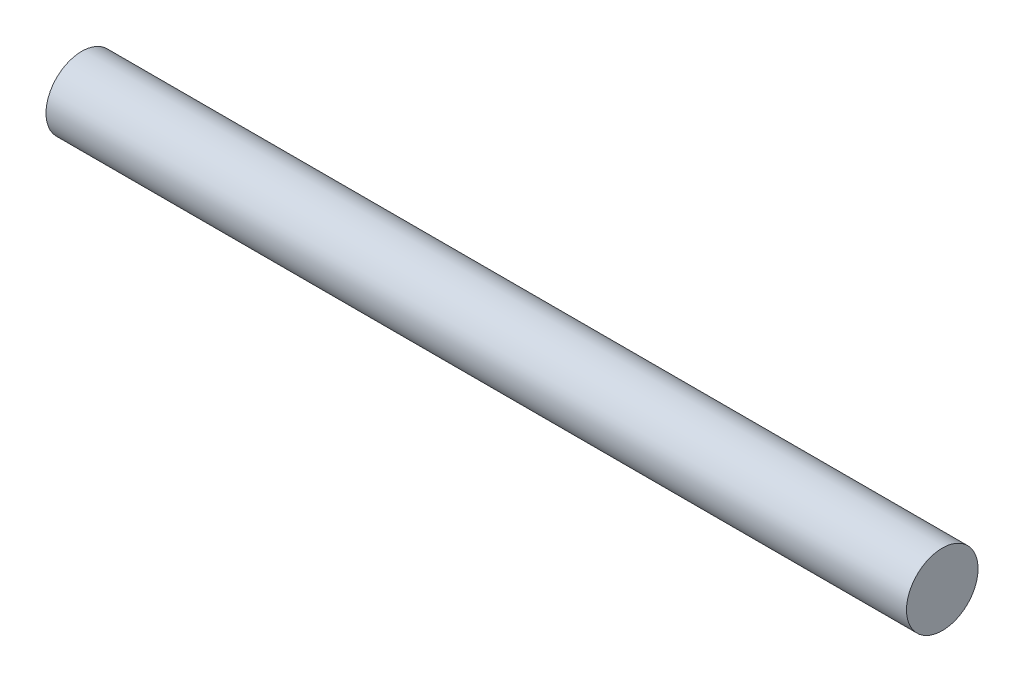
from build123d import *

# Parameters (mm, degrees)
SKETCH1_W = 76.962
SKETCH1_H = 3.2004


with BuildPart() as part:
    # Sketch1 → Revolve1 (revolve)
    with BuildSketch(Plane.XY, mode=Mode.PRIVATE) as revolve1_sk:
        with Locations((38.481, 1.6002)):
            Rectangle(SKETCH1_W, SKETCH1_H)
    revolve(revolve1_sk.sketch.rotate(Axis((76.962, 0, 0), (-1, 0, 0)), 270), axis=Axis((76.962, 0, 0), (-1, 0, 0)))


solid = part.part
